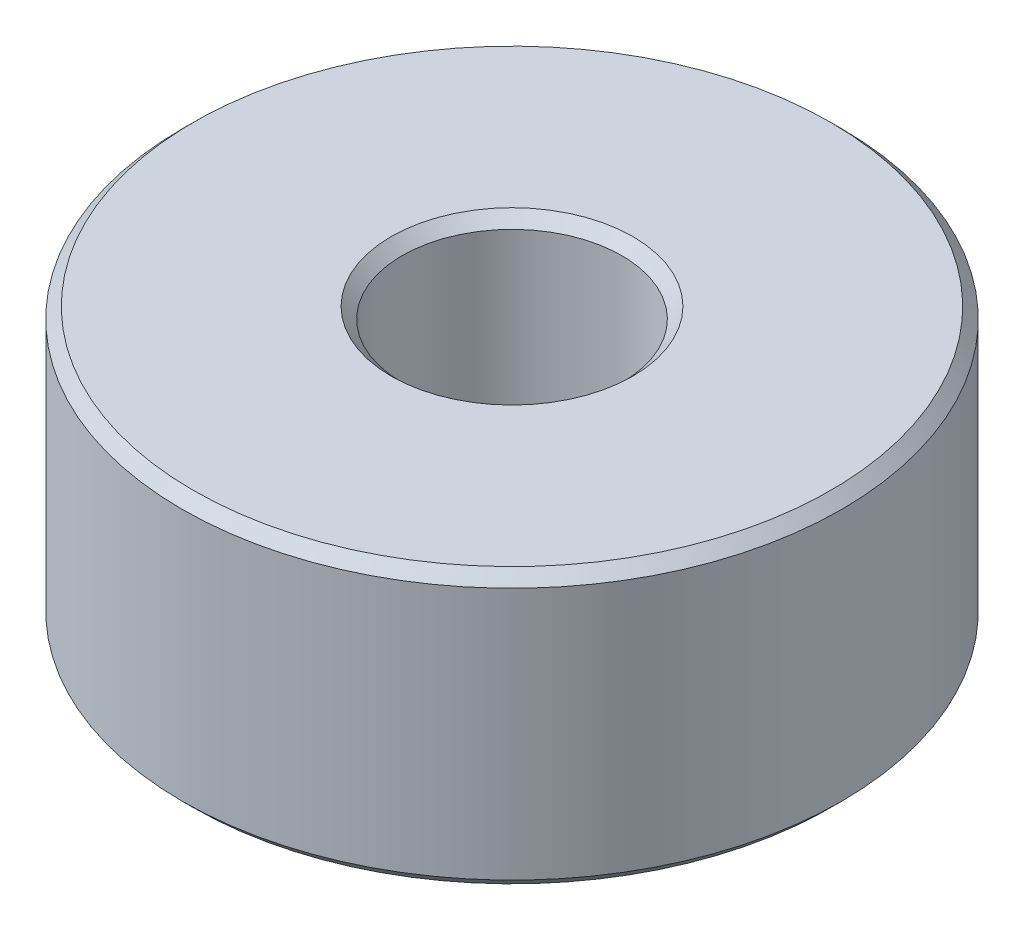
ISO-10303-21;
HEADER;
FILE_DESCRIPTION(('STEP AP214'),'2;1');
FILE_NAME('part.step','',(''),(''),'','','');
FILE_SCHEMA(('AUTOMOTIVE_DESIGN { 1 0 10303 214 1 1 1 1 }'));
ENDSEC;
DATA;
#1=APPLICATION_CONTEXT('core data for automotive mechanical design processes');
#2=APPLICATION_PROTOCOL_DEFINITION('international standard','automotive_design',2000,#1);
#3=PRODUCT_CONTEXT('',#1,'mechanical');
#4=PRODUCT('Part','Part','',(#3));
#5=PRODUCT_RELATED_PRODUCT_CATEGORY('part','',(#4));
#6=PRODUCT_DEFINITION_FORMATION('','',#4);
#7=PRODUCT_DEFINITION_CONTEXT('part definition',#1,'design');
#8=PRODUCT_DEFINITION('design','',#6,#7);
#9=PRODUCT_DEFINITION_SHAPE('','',#8);
#10=(LENGTH_UNIT() NAMED_UNIT(*) SI_UNIT(.MILLI.,.METRE.));
#11=(NAMED_UNIT(*) PLANE_ANGLE_UNIT() SI_UNIT($,.RADIAN.));
#12=(NAMED_UNIT(*) SI_UNIT($,.STERADIAN.) SOLID_ANGLE_UNIT());
#13=UNCERTAINTY_MEASURE_WITH_UNIT(LENGTH_MEASURE(1.E-05),#10,'distance_accuracy_value','');
#14=(GEOMETRIC_REPRESENTATION_CONTEXT(3) GLOBAL_UNCERTAINTY_ASSIGNED_CONTEXT((#13)) GLOBAL_UNIT_ASSIGNED_CONTEXT((#10,
#11,#12)) REPRESENTATION_CONTEXT('',''));
#15=CARTESIAN_POINT('',(0.,0.,0.));
#16=DIRECTION('',(0.,0.,1.));
#17=DIRECTION('',(1.,0.,0.));
#18=AXIS2_PLACEMENT_3D('',#15,#16,#17);
#19=CARTESIAN_POINT('',(0.,2.5,0.));
#20=DIRECTION('',(0.,-1.,0.));
#21=DIRECTION('',(0.,0.,-1.));
#22=AXIS2_PLACEMENT_3D('',#19,#20,#21);
#23=CYLINDRICAL_SURFACE('',#22,3.);
#24=CARTESIAN_POINT('',(0.,0.100000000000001,0.));
#25=DIRECTION('',(0.,1.,0.));
#26=DIRECTION('',(0.,0.,1.));
#27=AXIS2_PLACEMENT_3D('',#24,#25,#26);
#28=CIRCLE('',#27,3.);
#29=CARTESIAN_POINT('',(0.,0.100000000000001,3.));
#30=VERTEX_POINT('',#29);
#31=EDGE_CURVE('E54',#30,#30,#28,.T.);
#32=ORIENTED_EDGE('',*,*,#31,.T.);
#33=EDGE_LOOP('',(#32));
#34=FACE_BOUND('',#33,.T.);
#35=CARTESIAN_POINT('',(0.,2.4,0.));
#36=DIRECTION('',(0.,1.,0.));
#37=DIRECTION('',(0.,0.,1.));
#38=AXIS2_PLACEMENT_3D('',#35,#36,#37);
#39=CIRCLE('',#38,3.);
#40=CARTESIAN_POINT('',(0.,2.4,3.));
#41=VERTEX_POINT('',#40);
#42=EDGE_CURVE('E57',#41,#41,#39,.F.);
#43=ORIENTED_EDGE('',*,*,#42,.T.);
#44=EDGE_LOOP('',(#43));
#45=FACE_BOUND('',#44,.T.);
#46=ADVANCED_FACE('F33',(#34,#45),#23,.T.);
#47=CARTESIAN_POINT('',(0.,2.5,0.));
#48=DIRECTION('',(0.,1.,0.));
#49=DIRECTION('',(0.,0.,1.));
#50=AXIS2_PLACEMENT_3D('',#47,#48,#49);
#51=PLANE('',#50);
#52=CARTESIAN_POINT('',(0.,2.5,0.));
#53=DIRECTION('',(0.,1.,0.));
#54=DIRECTION('',(0.,0.,1.));
#55=AXIS2_PLACEMENT_3D('',#52,#53,#54);
#56=CIRCLE('',#55,2.9);
#57=CARTESIAN_POINT('',(0.,2.5,2.9));
#58=VERTEX_POINT('',#57);
#59=EDGE_CURVE('E41',#58,#58,#56,.T.);
#60=ORIENTED_EDGE('',*,*,#59,.T.);
#61=EDGE_LOOP('',(#60));
#62=FACE_BOUND('',#61,.T.);
#63=CARTESIAN_POINT('',(0.,2.5,0.));
#64=DIRECTION('',(0.,1.,0.));
#65=DIRECTION('',(0.,0.,1.));
#66=AXIS2_PLACEMENT_3D('',#63,#64,#65);
#67=CIRCLE('',#66,1.1);
#68=CARTESIAN_POINT('',(0.,2.5,1.1));
#69=VERTEX_POINT('',#68);
#70=EDGE_CURVE('E45',#69,#69,#67,.F.);
#71=ORIENTED_EDGE('',*,*,#70,.T.);
#72=EDGE_LOOP('',(#71));
#73=FACE_BOUND('',#72,.T.);
#74=ADVANCED_FACE('F77',(#62,#73),#51,.T.);
#75=CARTESIAN_POINT('',(0.,0.,0.));
#76=DIRECTION('',(0.,1.,0.));
#77=DIRECTION('',(0.,0.,1.));
#78=AXIS2_PLACEMENT_3D('',#75,#76,#77);
#79=PLANE('',#78);
#80=CARTESIAN_POINT('',(0.,0.,0.));
#81=DIRECTION('',(0.,1.,0.));
#82=DIRECTION('',(0.,0.,1.));
#83=AXIS2_PLACEMENT_3D('',#80,#81,#82);
#84=CIRCLE('',#83,2.9);
#85=CARTESIAN_POINT('',(0.,0.,2.9));
#86=VERTEX_POINT('',#85);
#87=EDGE_CURVE('E49',#86,#86,#84,.F.);
#88=ORIENTED_EDGE('',*,*,#87,.T.);
#89=EDGE_LOOP('',(#88));
#90=FACE_BOUND('',#89,.T.);
#91=CARTESIAN_POINT('',(0.,0.,0.));
#92=DIRECTION('',(0.,1.,0.));
#93=DIRECTION('',(0.,0.,1.));
#94=AXIS2_PLACEMENT_3D('',#91,#92,#93);
#95=CIRCLE('',#94,1.);
#96=CARTESIAN_POINT('',(0.,0.,1.));
#97=VERTEX_POINT('',#96);
#98=EDGE_CURVE('E60',#97,#97,#95,.T.);
#99=ORIENTED_EDGE('',*,*,#98,.T.);
#100=EDGE_LOOP('',(#99));
#101=FACE_BOUND('',#100,.T.);
#102=ADVANCED_FACE('F64',(#90,#101),#79,.F.);
#103=CARTESIAN_POINT('',(0.,-3.,0.));
#104=DIRECTION('',(0.,1.,0.));
#105=DIRECTION('',(0.,0.,1.));
#106=AXIS2_PLACEMENT_3D('',#103,#104,#105);
#107=CYLINDRICAL_SURFACE('',#106,1.);
#108=CARTESIAN_POINT('',(0.,2.4,0.));
#109=DIRECTION('',(0.,1.,0.));
#110=DIRECTION('',(0.,0.,1.));
#111=AXIS2_PLACEMENT_3D('',#108,#109,#110);
#112=CIRCLE('',#111,1.);
#113=CARTESIAN_POINT('',(0.,2.4,1.));
#114=VERTEX_POINT('',#113);
#115=EDGE_CURVE('E10',#114,#114,#112,.T.);
#116=ORIENTED_EDGE('',*,*,#115,.T.);
#117=EDGE_LOOP('',(#116));
#118=FACE_BOUND('',#117,.T.);
#119=ORIENTED_EDGE('',*,*,#98,.F.);
#120=EDGE_LOOP('',(#119));
#121=FACE_BOUND('',#120,.T.);
#122=ADVANCED_FACE('F66',(#118,#121),#107,.F.);
#123=CARTESIAN_POINT('',(0.,0.100000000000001,0.));
#124=DIRECTION('',(0.,1.,0.));
#125=DIRECTION('',(0.,0.,1.));
#126=AXIS2_PLACEMENT_3D('',#123,#124,#125);
#127=CONICAL_SURFACE('',#126,3.,0.785398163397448);
#128=ORIENTED_EDGE('',*,*,#87,.F.);
#129=EDGE_LOOP('',(#128));
#130=FACE_BOUND('',#129,.T.);
#131=ORIENTED_EDGE('',*,*,#31,.F.);
#132=EDGE_LOOP('',(#131));
#133=FACE_BOUND('',#132,.T.);
#134=ADVANCED_FACE('F68',(#130,#133),#127,.T.);
#135=CARTESIAN_POINT('',(0.,2.5,0.));
#136=DIRECTION('',(0.,-1.,0.));
#137=DIRECTION('',(0.,0.,-1.));
#138=AXIS2_PLACEMENT_3D('',#135,#136,#137);
#139=CONICAL_SURFACE('',#138,2.9,0.785398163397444);
#140=ORIENTED_EDGE('',*,*,#42,.F.);
#141=EDGE_LOOP('',(#140));
#142=FACE_BOUND('',#141,.T.);
#143=ORIENTED_EDGE('',*,*,#59,.F.);
#144=EDGE_LOOP('',(#143));
#145=FACE_BOUND('',#144,.T.);
#146=ADVANCED_FACE('F74',(#142,#145),#139,.T.);
#147=CARTESIAN_POINT('',(0.,2.4,0.));
#148=DIRECTION('',(0.,1.,0.));
#149=DIRECTION('',(0.,0.,1.));
#150=AXIS2_PLACEMENT_3D('',#147,#148,#149);
#151=CONICAL_SURFACE('',#150,1.,0.785398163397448);
#152=ORIENTED_EDGE('',*,*,#70,.F.);
#153=EDGE_LOOP('',(#152));
#154=FACE_BOUND('',#153,.T.);
#155=ORIENTED_EDGE('',*,*,#115,.F.);
#156=EDGE_LOOP('',(#155));
#157=FACE_BOUND('',#156,.T.);
#158=ADVANCED_FACE('F36',(#154,#157),#151,.F.);
#159=CLOSED_SHELL('',(#46,#74,#102,#122,#134,#146,#158));
#160=MANIFOLD_SOLID_BREP('B2',#159);
#161=ADVANCED_BREP_SHAPE_REPRESENTATION('',(#18,#160),#14);
#162=SHAPE_DEFINITION_REPRESENTATION(#9,#161);
ENDSEC;
END-ISO-10303-21;
